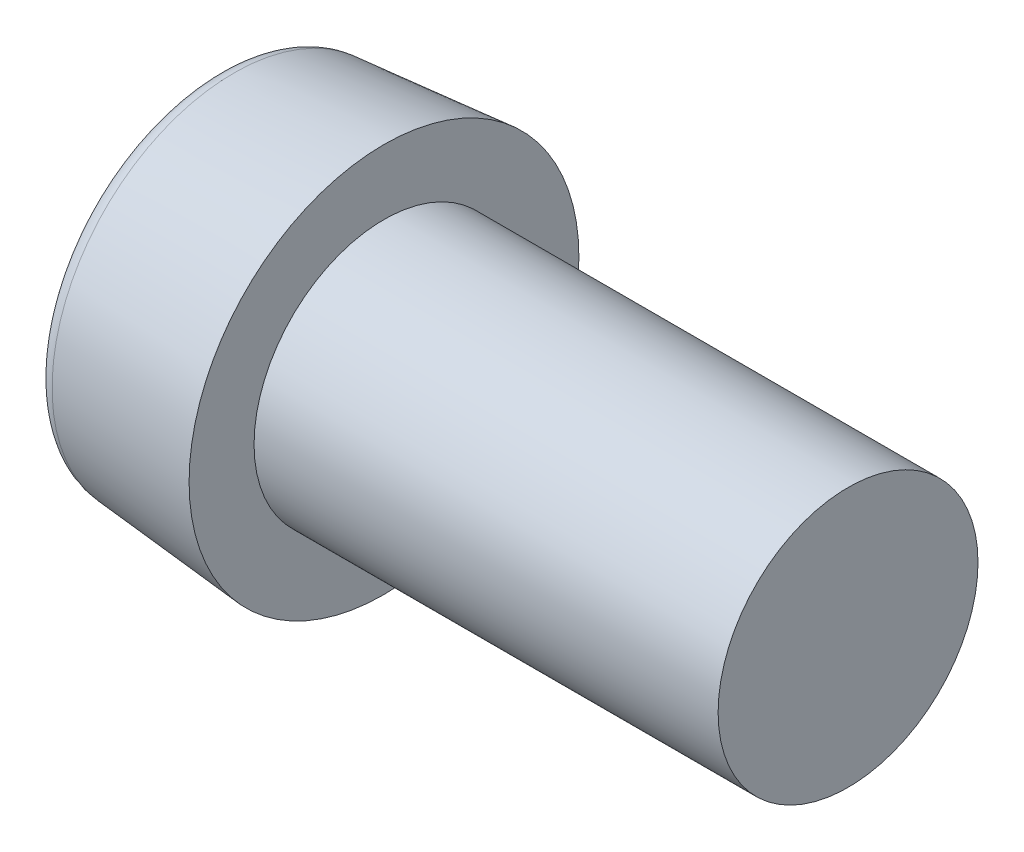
ISO-10303-21;
HEADER;
FILE_DESCRIPTION(('STEP AP214'),'2;1');
FILE_NAME('part.step','',(''),(''),'','','');
FILE_SCHEMA(('AUTOMOTIVE_DESIGN { 1 0 10303 214 1 1 1 1 }'));
ENDSEC;
DATA;
#1=APPLICATION_CONTEXT('core data for automotive mechanical design processes');
#2=APPLICATION_PROTOCOL_DEFINITION('international standard','automotive_design',2000,#1);
#3=PRODUCT_CONTEXT('',#1,'mechanical');
#4=PRODUCT('Part','Part','',(#3));
#5=PRODUCT_RELATED_PRODUCT_CATEGORY('part','',(#4));
#6=PRODUCT_DEFINITION_FORMATION('','',#4);
#7=PRODUCT_DEFINITION_CONTEXT('part definition',#1,'design');
#8=PRODUCT_DEFINITION('design','',#6,#7);
#9=PRODUCT_DEFINITION_SHAPE('','',#8);
#10=(LENGTH_UNIT() NAMED_UNIT(*) SI_UNIT(.MILLI.,.METRE.));
#11=(NAMED_UNIT(*) PLANE_ANGLE_UNIT() SI_UNIT($,.RADIAN.));
#12=(NAMED_UNIT(*) SI_UNIT($,.STERADIAN.) SOLID_ANGLE_UNIT());
#13=UNCERTAINTY_MEASURE_WITH_UNIT(LENGTH_MEASURE(1.E-05),#10,'distance_accuracy_value','');
#14=(GEOMETRIC_REPRESENTATION_CONTEXT(3) GLOBAL_UNCERTAINTY_ASSIGNED_CONTEXT((#13)) GLOBAL_UNIT_ASSIGNED_CONTEXT((#10,
#11,#12)) REPRESENTATION_CONTEXT('',''));
#15=CARTESIAN_POINT('',(0.,0.,0.));
#16=DIRECTION('',(0.,0.,1.));
#17=DIRECTION('',(1.,0.,0.));
#18=AXIS2_PLACEMENT_3D('',#15,#16,#17);
#19=CARTESIAN_POINT('',(0.,0.,0.));
#20=DIRECTION('',(1.,0.,0.));
#21=DIRECTION('',(0.,0.,-1.));
#22=AXIS2_PLACEMENT_3D('',#19,#20,#21);
#23=PLANE('',#22);
#24=CARTESIAN_POINT('',(0.,0.,0.));
#25=DIRECTION('',(1.,0.,0.));
#26=DIRECTION('',(0.,0.,-1.));
#27=AXIS2_PLACEMENT_3D('',#24,#25,#26);
#28=CIRCLE('',#27,8.79627085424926);
#29=CARTESIAN_POINT('',(0.,0.,-8.79627085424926));
#30=VERTEX_POINT('',#29);
#31=EDGE_CURVE('E11',#30,#30,#28,.F.);
#32=ORIENTED_EDGE('',*,*,#31,.T.);
#33=EDGE_LOOP('',(#32));
#34=FACE_BOUND('',#33,.T.);
#35=CARTESIAN_POINT('',(0.,3.5507041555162,-2.05));
#36=CARTESIAN_POINT('',(0.,4.00592263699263,-1.26153846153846));
#37=CARTESIAN_POINT('',(0.,5.46262177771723,0.));
#38=CARTESIAN_POINT('',(0.,3.27757306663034,1.89230769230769));
#39=CARTESIAN_POINT('',(0.,2.73131088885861,4.73076923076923));
#40=CARTESIAN_POINT('',(0.,0.,3.78461538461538));
#41=CARTESIAN_POINT('',(0.,-2.73131088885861,4.73076923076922));
#42=CARTESIAN_POINT('',(0.,-3.27757306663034,1.8923076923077));
#43=CARTESIAN_POINT('',(0.,-5.46262177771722,0.));
#44=CARTESIAN_POINT('',(0.,-3.27757306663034,-1.89230769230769));
#45=CARTESIAN_POINT('',(0.,-2.73131088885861,-4.73076923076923));
#46=CARTESIAN_POINT('',(0.,0.,-3.78461538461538));
#47=CARTESIAN_POINT('',(0.,2.73131088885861,-4.73076923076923));
#48=CARTESIAN_POINT('',(0.,3.09548567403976,-2.83846153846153));
#49=CARTESIAN_POINT('',(0.,3.5507041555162,-2.05));
#50=B_SPLINE_CURVE_WITH_KNOTS('',3,(#35,#36,#37,#38,#39,#40,#41,#42,#43,#44,#45,#46,#47,#48,
#49),.UNSPECIFIED.,.T.,.F.,(4,1,1,1,1,1,1,1,1,1,1,1,4),(0.,0.0833333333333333,0.166666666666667,
0.25,0.333333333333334,0.416666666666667,0.5,0.583333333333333,0.666666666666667,0.75,
0.833333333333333,0.916666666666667,1.),.UNSPECIFIED.);
#51=CARTESIAN_POINT('',(0.,3.5507041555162,-2.05));
#52=VERTEX_POINT('',#51);
#53=EDGE_CURVE('E35',#52,#52,#50,.T.);
#54=ORIENTED_EDGE('',*,*,#53,.T.);
#55=EDGE_LOOP('',(#54));
#56=FACE_BOUND('',#55,.T.);
#57=ADVANCED_FACE('F16',(#34,#56),#23,.F.);
#58=CARTESIAN_POINT('',(9.,0.,0.));
#59=DIRECTION('',(1.,0.,0.));
#60=DIRECTION('',(0.,0.,-1.));
#61=AXIS2_PLACEMENT_3D('',#58,#59,#60);
#62=CONICAL_SURFACE('',#61,10.5,0.0872664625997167);
#63=CARTESIAN_POINT('',(0.912844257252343,0.,0.));
#64=DIRECTION('',(1.,0.,0.));
#65=DIRECTION('',(0.,0.,-1.));
#66=AXIS2_PLACEMENT_3D('',#63,#64,#65);
#67=CIRCLE('',#66,9.79246555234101);
#68=CARTESIAN_POINT('',(0.912844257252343,0.,-9.79246555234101));
#69=VERTEX_POINT('',#68);
#70=EDGE_CURVE('E23',#69,#69,#67,.T.);
#71=ORIENTED_EDGE('',*,*,#70,.T.);
#72=EDGE_LOOP('',(#71));
#73=FACE_BOUND('',#72,.T.);
#74=CARTESIAN_POINT('',(9.,0.,0.));
#75=DIRECTION('',(1.,0.,0.));
#76=DIRECTION('',(0.,0.,-1.));
#77=AXIS2_PLACEMENT_3D('',#74,#75,#76);
#78=CIRCLE('',#77,10.5);
#79=CARTESIAN_POINT('',(9.,0.,-10.5));
#80=VERTEX_POINT('',#79);
#81=EDGE_CURVE('E86',#80,#80,#78,.T.);
#82=ORIENTED_EDGE('',*,*,#81,.F.);
#83=EDGE_LOOP('',(#82));
#84=FACE_BOUND('',#83,.T.);
#85=ADVANCED_FACE('F71',(#73,#84),#62,.T.);
#86=CARTESIAN_POINT('',(9.,0.,0.));
#87=DIRECTION('',(1.,0.,0.));
#88=DIRECTION('',(0.,0.,-1.));
#89=AXIS2_PLACEMENT_3D('',#86,#87,#88);
#90=PLANE('',#89);
#91=CARTESIAN_POINT('',(9.,0.,0.));
#92=DIRECTION('',(-1.,0.,0.));
#93=DIRECTION('',(0.,0.,1.));
#94=AXIS2_PLACEMENT_3D('',#91,#92,#93);
#95=CIRCLE('',#94,7.);
#96=CARTESIAN_POINT('',(9.,0.,7.));
#97=VERTEX_POINT('',#96);
#98=EDGE_CURVE('E38',#97,#97,#95,.T.);
#99=ORIENTED_EDGE('',*,*,#98,.T.);
#100=EDGE_LOOP('',(#99));
#101=FACE_BOUND('',#100,.T.);
#102=ORIENTED_EDGE('',*,*,#81,.T.);
#103=EDGE_LOOP('',(#102));
#104=FACE_BOUND('',#103,.T.);
#105=ADVANCED_FACE('F67',(#101,#104),#90,.T.);
#106=CARTESIAN_POINT('',(34.,7.,0.));
#107=DIRECTION('',(-1.,0.,0.));
#108=DIRECTION('',(0.,0.,1.));
#109=AXIS2_PLACEMENT_3D('',#106,#107,#108);
#110=PLANE('',#109);
#111=CARTESIAN_POINT('',(34.,0.,0.));
#112=DIRECTION('',(-1.,0.,0.));
#113=DIRECTION('',(0.,0.,1.));
#114=AXIS2_PLACEMENT_3D('',#111,#112,#113);
#115=CIRCLE('',#114,7.);
#116=CARTESIAN_POINT('',(34.,0.,7.));
#117=VERTEX_POINT('',#116);
#118=EDGE_CURVE('E89',#117,#117,#115,.T.);
#119=ORIENTED_EDGE('',*,*,#118,.F.);
#120=EDGE_LOOP('',(#119));
#121=FACE_BOUND('',#120,.T.);
#122=ADVANCED_FACE('F63',(#121),#110,.F.);
#123=CARTESIAN_POINT('',(0.,0.,0.));
#124=DIRECTION('',(-1.,0.,0.));
#125=DIRECTION('',(0.,0.,1.));
#126=AXIS2_PLACEMENT_3D('',#123,#124,#125);
#127=CYLINDRICAL_SURFACE('',#126,7.);
#128=ORIENTED_EDGE('',*,*,#98,.F.);
#129=EDGE_LOOP('',(#128));
#130=FACE_BOUND('',#129,.T.);
#131=ORIENTED_EDGE('',*,*,#118,.T.);
#132=EDGE_LOOP('',(#131));
#133=FACE_BOUND('',#132,.T.);
#134=ADVANCED_FACE('F58',(#130,#133),#127,.T.);
#135=CARTESIAN_POINT('',(4.,3.5507041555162,-2.05));
#136=CARTESIAN_POINT('',(4.,4.00592263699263,-1.26153846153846));
#137=CARTESIAN_POINT('',(4.,5.46262177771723,0.));
#138=CARTESIAN_POINT('',(4.,3.27757306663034,1.89230769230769));
#139=CARTESIAN_POINT('',(4.,2.73131088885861,4.73076923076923));
#140=CARTESIAN_POINT('',(4.,0.,3.78461538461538));
#141=CARTESIAN_POINT('',(4.,-2.73131088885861,4.73076923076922));
#142=CARTESIAN_POINT('',(4.,-3.27757306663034,1.8923076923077));
#143=CARTESIAN_POINT('',(4.,-5.46262177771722,0.));
#144=CARTESIAN_POINT('',(4.,-3.27757306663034,-1.89230769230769));
#145=CARTESIAN_POINT('',(4.,-2.73131088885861,-4.73076923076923));
#146=CARTESIAN_POINT('',(4.,0.,-3.78461538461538));
#147=CARTESIAN_POINT('',(4.,2.73131088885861,-4.73076923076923));
#148=CARTESIAN_POINT('',(4.,3.09548567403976,-2.83846153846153));
#149=CARTESIAN_POINT('',(4.,3.5507041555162,-2.05));
#150=B_SPLINE_CURVE_WITH_KNOTS('',3,(#135,#136,#137,#138,#139,#140,#141,#142,#143,#144,#145,
#146,#147,#148,#149),.UNSPECIFIED.,.T.,.F.,(4,1,1,1,1,1,1,1,1,1,1,1,4),(0.,0.0833333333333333,
0.166666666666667,0.25,0.333333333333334,0.416666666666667,0.5,0.583333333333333,
0.666666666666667,0.75,0.833333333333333,0.916666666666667,1.),.UNSPECIFIED.);
#151=DIRECTION('',(-1.,0.,0.));
#152=VECTOR('',#151,1.);
#153=SURFACE_OF_LINEAR_EXTRUSION('',#150,#152);
#154=CARTESIAN_POINT('',(4.,3.5507041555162,-2.05));
#155=CARTESIAN_POINT('',(4.,3.09548567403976,-2.83846153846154));
#156=CARTESIAN_POINT('',(4.,2.73131088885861,-4.73076923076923));
#157=CARTESIAN_POINT('',(4.,0.,-3.78461538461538));
#158=CARTESIAN_POINT('',(4.,-2.73131088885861,-4.73076923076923));
#159=CARTESIAN_POINT('',(4.,-3.27757306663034,-1.89230769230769));
#160=CARTESIAN_POINT('',(4.,-5.46262177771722,0.));
#161=CARTESIAN_POINT('',(4.,-3.27757306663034,1.8923076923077));
#162=CARTESIAN_POINT('',(4.,-2.73131088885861,4.73076923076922));
#163=CARTESIAN_POINT('',(4.,0.,3.78461538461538));
#164=CARTESIAN_POINT('',(4.,2.73131088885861,4.73076923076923));
#165=CARTESIAN_POINT('',(4.,3.27757306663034,1.89230769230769));
#166=CARTESIAN_POINT('',(4.,5.46262177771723,0.));
#167=CARTESIAN_POINT('',(4.,4.00592263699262,-1.26153846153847));
#168=CARTESIAN_POINT('',(4.,3.5507041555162,-2.05));
#169=B_SPLINE_CURVE_WITH_KNOTS('',3,(#154,#155,#156,#157,#158,#159,#160,#161,#162,#163,#164,
#165,#166,#167,#168),.UNSPECIFIED.,.T.,.F.,(4,1,1,1,1,1,1,1,1,1,1,1,4),(0.,0.0833333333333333,
0.166666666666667,0.25,0.333333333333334,0.416666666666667,0.5,0.583333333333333,
0.666666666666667,0.75,0.833333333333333,0.916666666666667,1.),.UNSPECIFIED.);
#170=CARTESIAN_POINT('',(4.,3.5507041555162,-2.05));
#171=VERTEX_POINT('',#170);
#172=EDGE_CURVE('E33',#171,#171,#169,.T.);
#173=ORIENTED_EDGE('',*,*,#172,.F.);
#174=EDGE_LOOP('',(#173));
#175=FACE_BOUND('',#174,.T.);
#176=ORIENTED_EDGE('',*,*,#53,.F.);
#177=EDGE_LOOP('',(#176));
#178=FACE_BOUND('',#177,.T.);
#179=ADVANCED_FACE('F29',(#175,#178),#153,.T.);
#180=CARTESIAN_POINT('',(5.33333333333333,0.,0.));
#181=CARTESIAN_POINT('',(4.,3.5507041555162,-2.05));
#182=CARTESIAN_POINT('',(5.33333333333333,0.,0.));
#183=CARTESIAN_POINT('',(4.,3.09548567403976,-2.83846153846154));
#184=CARTESIAN_POINT('',(5.33333333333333,0.,0.));
#185=CARTESIAN_POINT('',(4.,2.73131088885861,-4.73076923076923));
#186=CARTESIAN_POINT('',(5.33333333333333,0.,0.));
#187=CARTESIAN_POINT('',(4.,0.,-3.78461538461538));
#188=CARTESIAN_POINT('',(5.33333333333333,0.,0.));
#189=CARTESIAN_POINT('',(4.,-2.73131088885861,-4.73076923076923));
#190=CARTESIAN_POINT('',(5.33333333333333,0.,0.));
#191=CARTESIAN_POINT('',(4.,-3.27757306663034,-1.89230769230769));
#192=CARTESIAN_POINT('',(5.33333333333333,0.,0.));
#193=CARTESIAN_POINT('',(4.,-5.46262177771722,0.));
#194=CARTESIAN_POINT('',(5.33333333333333,0.,0.));
#195=CARTESIAN_POINT('',(4.,-3.27757306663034,1.8923076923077));
#196=CARTESIAN_POINT('',(5.33333333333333,0.,0.));
#197=CARTESIAN_POINT('',(4.,-2.73131088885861,4.73076923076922));
#198=CARTESIAN_POINT('',(5.33333333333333,0.,0.));
#199=CARTESIAN_POINT('',(4.,0.,3.78461538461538));
#200=CARTESIAN_POINT('',(5.33333333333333,0.,0.));
#201=CARTESIAN_POINT('',(4.,2.73131088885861,4.73076923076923));
#202=CARTESIAN_POINT('',(5.33333333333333,0.,0.));
#203=CARTESIAN_POINT('',(4.,3.27757306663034,1.89230769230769));
#204=CARTESIAN_POINT('',(5.33333333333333,0.,0.));
#205=CARTESIAN_POINT('',(4.,5.46262177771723,0.));
#206=CARTESIAN_POINT('',(5.33333333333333,0.,0.));
#207=CARTESIAN_POINT('',(4.,4.00592263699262,-1.26153846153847));
#208=CARTESIAN_POINT('',(5.33333333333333,0.,0.));
#209=CARTESIAN_POINT('',(4.,3.5507041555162,-2.05));
#210=B_SPLINE_SURFACE_WITH_KNOTS('',3,1,((#180,#181),(#182,#183),(#184,#185),(#186,#187),(#188,
#189),(#190,#191),(#192,#193),(#194,#195),(#196,#197),(#198,#199),(#200,#201),(#202,#203),(#204,
#205),(#206,#207),(#208,#209)),.UNSPECIFIED.,.T.,.F.,.F.,(4,1,1,1,1,1,1,1,1,1,1,1,4),(2,2),(0.,
0.0833333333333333,0.166666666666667,0.25,0.333333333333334,0.416666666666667,0.5,
0.583333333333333,0.666666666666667,0.75,0.833333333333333,0.916666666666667,1.),(0.,1.),.UNSPECIFIED.);
#211=CARTESIAN_POINT('',(5.33333333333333,0.,0.));
#212=VERTEX_POINT('',#211);
#213=VERTEX_LOOP('',#212);
#214=FACE_BOUND('',#213,.T.);
#215=ORIENTED_EDGE('',*,*,#172,.T.);
#216=EDGE_LOOP('',(#215));
#217=FACE_BOUND('',#216,.T.);
#218=ADVANCED_FACE('F26',(#214,#217),#210,.F.);
#219=CARTESIAN_POINT('',(1.,0.,0.));
#220=DIRECTION('',(1.,0.,0.));
#221=DIRECTION('',(0.,0.,-1.));
#222=AXIS2_PLACEMENT_3D('',#219,#220,#221);
#223=TOROIDAL_SURFACE('',#222,8.79627085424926,1.);
#224=ORIENTED_EDGE('',*,*,#31,.F.);
#225=EDGE_LOOP('',(#224));
#226=FACE_BOUND('',#225,.T.);
#227=ORIENTED_EDGE('',*,*,#70,.F.);
#228=EDGE_LOOP('',(#227));
#229=FACE_BOUND('',#228,.T.);
#230=ADVANCED_FACE('F18',(#226,#229),#223,.T.);
#231=CLOSED_SHELL('',(#57,#85,#105,#122,#134,#179,#218,#230));
#232=MANIFOLD_SOLID_BREP('B1',#231);
#233=ADVANCED_BREP_SHAPE_REPRESENTATION('',(#18,#232),#14);
#234=SHAPE_DEFINITION_REPRESENTATION(#9,#233);
ENDSEC;
END-ISO-10303-21;
